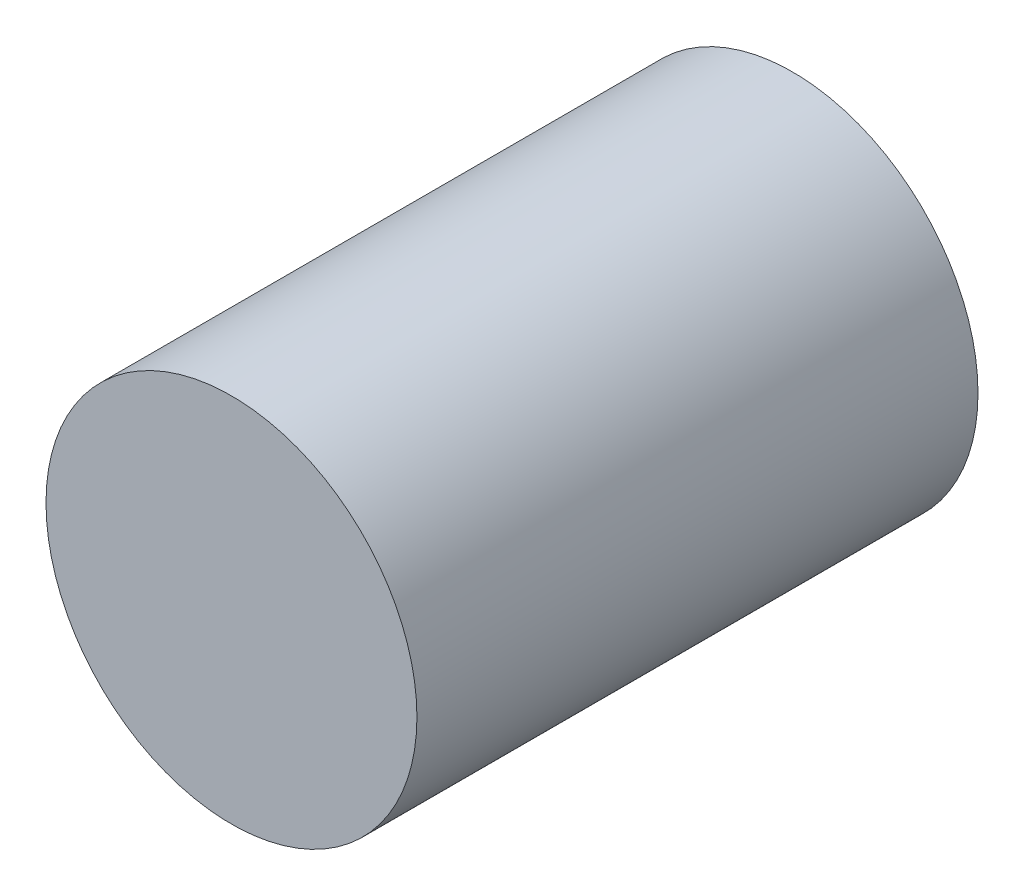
from build123d import *

# Parameters (mm, degrees)
SKETCH_1_R      = 4
EXTRUDE_1_DEPTH = 12.1


with BuildPart() as part:
    # Sketch 1 → Extrude 1 (new body)
    with BuildSketch(Plane.XY):
        with Locations((47.991088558, -2.815383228)):
            Circle(SKETCH_1_R)
    extrude(amount=EXTRUDE_1_DEPTH)


solid = part.part
